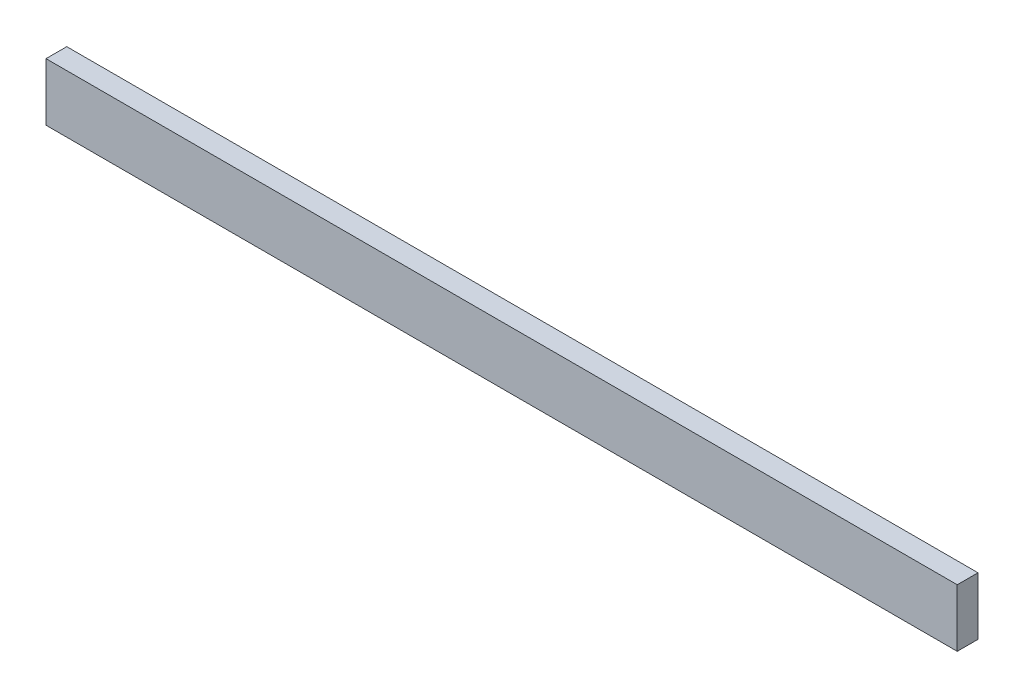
from build123d import *

# Parameters (mm, degrees)
ESBO_O1_W                = 790
ESBO_O1_H                = 50
RESSALTO_EXTRUS_O1_DEPTH = 18


with BuildPart() as part:
    # Esbo_o1 → Ressalto-extrus_o1 (new body)
    with BuildSketch(Plane.XY):
        with Locations((404, -975)):
            Rectangle(ESBO_O1_W, ESBO_O1_H)
    extrude(amount=-RESSALTO_EXTRUS_O1_DEPTH)


solid = part.part
